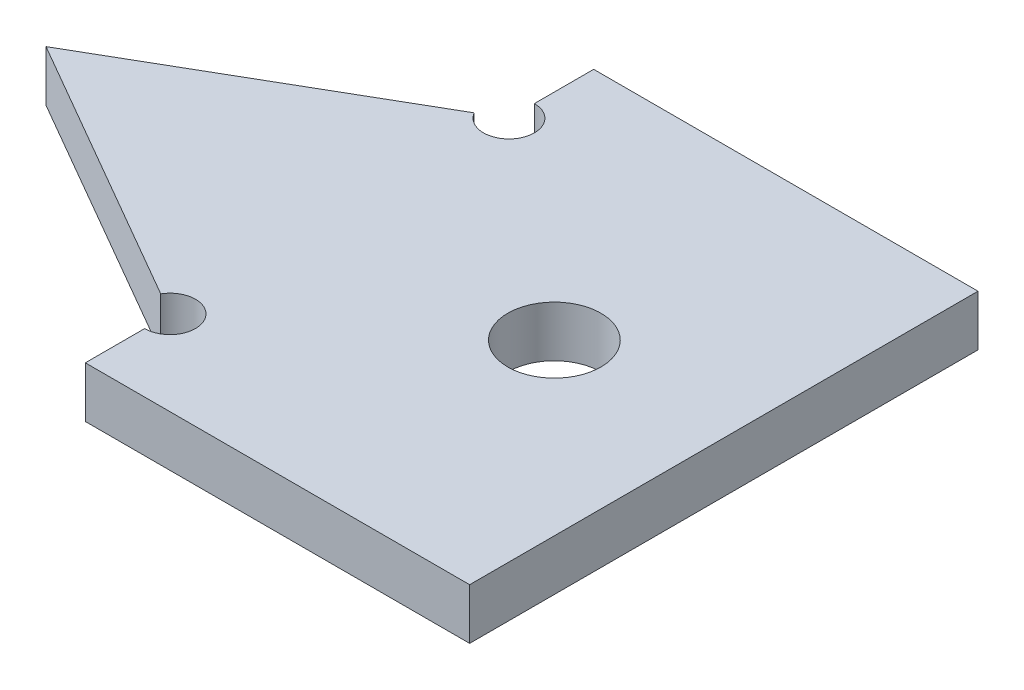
from build123d import *

# Parameters (mm, degrees)
SKETCH1_R      = 2.75
EXTRUDE1_DEPTH = 3


with BuildPart() as part:
    # Sketch1 → Extrude1 (new body)
    with BuildSketch(Plane(origin=(0, 0, 0), x_dir=(1, 0, 0), z_dir=(0, 1, 0))):
        with BuildLine():
            Line((17.320508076, 30), (17.320508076, 26.5))
            ThreePointArc((17.320508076, 26.5), (18.619546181, 24.25), (16.02146997, 24.25))
            Line((16.02146997, 24.25), (0, 15))
            Line((0, 15), (16.02146997, 5.75))
            ThreePointArc((16.02146997, 5.75), (18.619546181, 5.75), (17.320508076, 3.5))
            Line((17.320508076, 3.5), (17.320508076, 0))
            Line((17.320508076, 0), (40, 0))
            Line((40, 0), (40, 30))
            Line((40, 30), (17.320508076, 30))
        make_face()
        with Locations(Location((30, 15, 0), (0, 0, 270))):
            Circle(SKETCH1_R, mode=Mode.SUBTRACT)
    extrude(amount=EXTRUDE1_DEPTH)


solid = part.part
